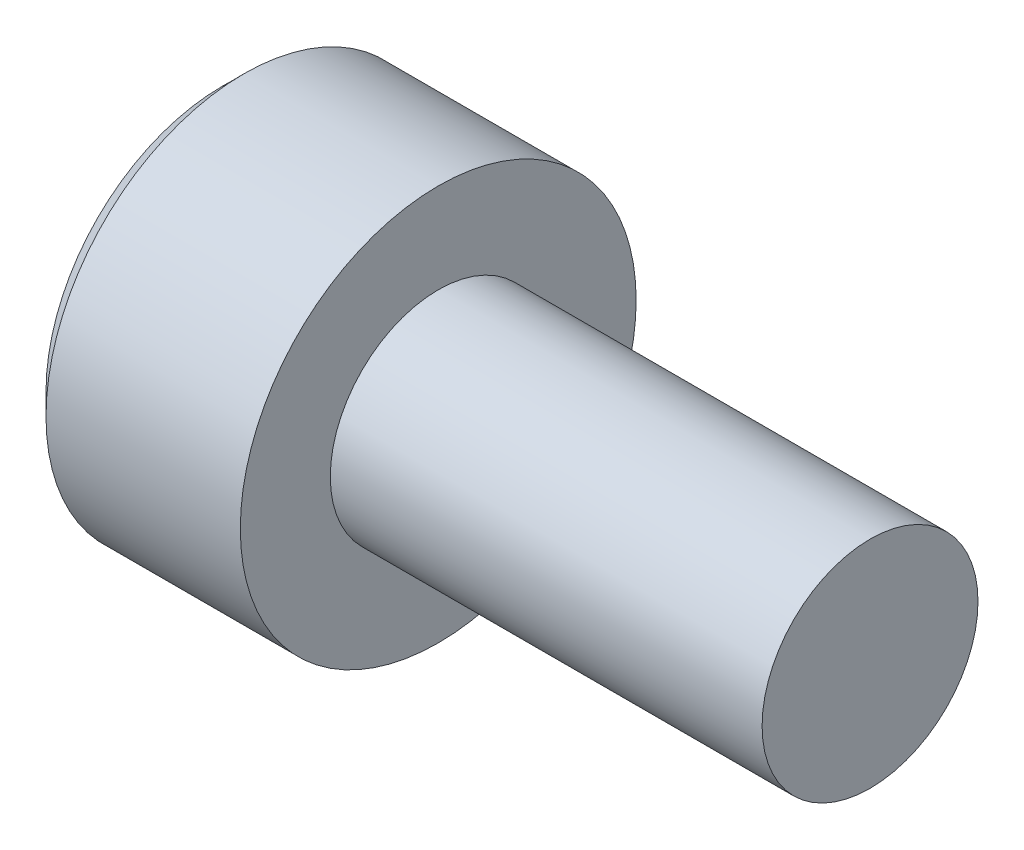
ISO-10303-21;
HEADER;
FILE_DESCRIPTION(('STEP AP214'),'2;1');
FILE_NAME('part.step','',(''),(''),'','','');
FILE_SCHEMA(('AUTOMOTIVE_DESIGN { 1 0 10303 214 1 1 1 1 }'));
ENDSEC;
DATA;
#1=APPLICATION_CONTEXT('core data for automotive mechanical design processes');
#2=APPLICATION_PROTOCOL_DEFINITION('international standard','automotive_design',2000,#1);
#3=PRODUCT_CONTEXT('',#1,'mechanical');
#4=PRODUCT('Part','Part','',(#3));
#5=PRODUCT_RELATED_PRODUCT_CATEGORY('part','',(#4));
#6=PRODUCT_DEFINITION_FORMATION('','',#4);
#7=PRODUCT_DEFINITION_CONTEXT('part definition',#1,'design');
#8=PRODUCT_DEFINITION('design','',#6,#7);
#9=PRODUCT_DEFINITION_SHAPE('','',#8);
#10=(LENGTH_UNIT() NAMED_UNIT(*) SI_UNIT(.MILLI.,.METRE.));
#11=(NAMED_UNIT(*) PLANE_ANGLE_UNIT() SI_UNIT($,.RADIAN.));
#12=(NAMED_UNIT(*) SI_UNIT($,.STERADIAN.) SOLID_ANGLE_UNIT());
#13=UNCERTAINTY_MEASURE_WITH_UNIT(LENGTH_MEASURE(1.E-05),#10,'distance_accuracy_value','');
#14=(GEOMETRIC_REPRESENTATION_CONTEXT(3) GLOBAL_UNCERTAINTY_ASSIGNED_CONTEXT((#13)) GLOBAL_UNIT_ASSIGNED_CONTEXT((#10,
#11,#12)) REPRESENTATION_CONTEXT('',''));
#15=CARTESIAN_POINT('',(0.,0.,0.));
#16=DIRECTION('',(0.,0.,1.));
#17=DIRECTION('',(1.,0.,0.));
#18=AXIS2_PLACEMENT_3D('',#15,#16,#17);
#19=CARTESIAN_POINT('',(-3.,2.75,0.));
#20=DIRECTION('',(1.,0.,0.));
#21=DIRECTION('',(0.,0.,-1.));
#22=AXIS2_PLACEMENT_3D('',#19,#20,#21);
#23=PLANE('',#22);
#24=CARTESIAN_POINT('',(-3.,0.,0.));
#25=DIRECTION('',(1.,0.,0.));
#26=DIRECTION('',(0.,0.,-1.));
#27=AXIS2_PLACEMENT_3D('',#24,#25,#26);
#28=CIRCLE('',#27,2.45);
#29=CARTESIAN_POINT('',(-3.,0.,-2.45));
#30=VERTEX_POINT('',#29);
#31=EDGE_CURVE('E45',#30,#30,#28,.F.);
#32=ORIENTED_EDGE('',*,*,#31,.T.);
#33=EDGE_LOOP('',(#32));
#34=FACE_BOUND('',#33,.T.);
#35=DIRECTION('',(0.,0.5,0.866025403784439));
#36=VECTOR('',#35,1.);
#37=CARTESIAN_POINT('',(-3.,-1.44337567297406,0.));
#38=LINE('',#37,#36);
#39=CARTESIAN_POINT('',(-3.,-1.44337567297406,0.));
#40=VERTEX_POINT('',#39);
#41=CARTESIAN_POINT('',(-3.,-0.721687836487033,1.25));
#42=VERTEX_POINT('',#41);
#43=EDGE_CURVE('E152',#40,#42,#38,.T.);
#44=ORIENTED_EDGE('',*,*,#43,.F.);
#45=DIRECTION('',(0.,-0.5,0.866025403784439));
#46=VECTOR('',#45,1.);
#47=CARTESIAN_POINT('',(-3.,-0.721687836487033,-1.25));
#48=LINE('',#47,#46);
#49=CARTESIAN_POINT('',(-3.,-0.721687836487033,-1.25));
#50=VERTEX_POINT('',#49);
#51=EDGE_CURVE('E52',#50,#40,#48,.T.);
#52=ORIENTED_EDGE('',*,*,#51,.F.);
#53=DIRECTION('',(0.,-1.,0.));
#54=VECTOR('',#53,1.);
#55=CARTESIAN_POINT('',(-3.,0.721687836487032,-1.25));
#56=LINE('',#55,#54);
#57=CARTESIAN_POINT('',(-3.,0.721687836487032,-1.25));
#58=VERTEX_POINT('',#57);
#59=EDGE_CURVE('E122',#58,#50,#56,.T.);
#60=ORIENTED_EDGE('',*,*,#59,.F.);
#61=DIRECTION('',(0.,-0.5,-0.866025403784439));
#62=VECTOR('',#61,1.);
#63=CARTESIAN_POINT('',(-3.,1.44337567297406,0.));
#64=LINE('',#63,#62);
#65=CARTESIAN_POINT('',(-3.,1.44337567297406,0.));
#66=VERTEX_POINT('',#65);
#67=EDGE_CURVE('E158',#66,#58,#64,.T.);
#68=ORIENTED_EDGE('',*,*,#67,.F.);
#69=DIRECTION('',(0.,0.5,-0.866025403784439));
#70=VECTOR('',#69,1.);
#71=CARTESIAN_POINT('',(-3.,0.721687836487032,1.25));
#72=LINE('',#71,#70);
#73=CARTESIAN_POINT('',(-3.,0.721687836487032,1.25));
#74=VERTEX_POINT('',#73);
#75=EDGE_CURVE('E156',#74,#66,#72,.T.);
#76=ORIENTED_EDGE('',*,*,#75,.F.);
#77=DIRECTION('',(0.,1.,0.));
#78=VECTOR('',#77,1.);
#79=CARTESIAN_POINT('',(-3.,-0.721687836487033,1.25));
#80=LINE('',#79,#78);
#81=EDGE_CURVE('E154',#42,#74,#80,.T.);
#82=ORIENTED_EDGE('',*,*,#81,.F.);
#83=EDGE_LOOP('',(#44,#52,#60,#68,#76,#82));
#84=FACE_BOUND('',#83,.T.);
#85=ADVANCED_FACE('F37',(#34,#84),#23,.F.);
#86=CARTESIAN_POINT('',(6.,0.,0.));
#87=DIRECTION('',(-1.,0.,0.));
#88=DIRECTION('',(0.,0.,1.));
#89=AXIS2_PLACEMENT_3D('',#86,#87,#88);
#90=PLANE('',#89);
#91=CARTESIAN_POINT('',(6.,0.,0.));
#92=DIRECTION('',(-1.,0.,0.));
#93=DIRECTION('',(0.,0.,1.));
#94=AXIS2_PLACEMENT_3D('',#91,#92,#93);
#95=CIRCLE('',#94,1.5);
#96=CARTESIAN_POINT('',(6.,0.,1.5));
#97=VERTEX_POINT('',#96);
#98=EDGE_CURVE('E184',#97,#97,#95,.T.);
#99=ORIENTED_EDGE('',*,*,#98,.F.);
#100=EDGE_LOOP('',(#99));
#101=FACE_BOUND('',#100,.T.);
#102=ADVANCED_FACE('F205',(#101),#90,.F.);
#103=CARTESIAN_POINT('',(-3.,0.,0.));
#104=DIRECTION('',(-1.,0.,0.));
#105=DIRECTION('',(0.,0.,1.));
#106=AXIS2_PLACEMENT_3D('',#103,#104,#105);
#107=CYLINDRICAL_SURFACE('',#106,1.5);
#108=CARTESIAN_POINT('',(0.,0.,0.));
#109=DIRECTION('',(-1.,0.,0.));
#110=DIRECTION('',(0.,0.,1.));
#111=AXIS2_PLACEMENT_3D('',#108,#109,#110);
#112=CIRCLE('',#111,1.5);
#113=CARTESIAN_POINT('',(0.,0.,1.5));
#114=VERTEX_POINT('',#113);
#115=EDGE_CURVE('E181',#114,#114,#112,.T.);
#116=ORIENTED_EDGE('',*,*,#115,.F.);
#117=EDGE_LOOP('',(#116));
#118=FACE_BOUND('',#117,.T.);
#119=ORIENTED_EDGE('',*,*,#98,.T.);
#120=EDGE_LOOP('',(#119));
#121=FACE_BOUND('',#120,.T.);
#122=ADVANCED_FACE('F209',(#118,#121),#107,.T.);
#123=CARTESIAN_POINT('',(0.,1.5,0.));
#124=DIRECTION('',(-1.,0.,0.));
#125=DIRECTION('',(0.,0.,1.));
#126=AXIS2_PLACEMENT_3D('',#123,#124,#125);
#127=PLANE('',#126);
#128=CARTESIAN_POINT('',(0.,0.,0.));
#129=DIRECTION('',(-1.,0.,0.));
#130=DIRECTION('',(0.,0.,1.));
#131=AXIS2_PLACEMENT_3D('',#128,#129,#130);
#132=CIRCLE('',#131,2.75);
#133=CARTESIAN_POINT('',(0.,0.,2.75));
#134=VERTEX_POINT('',#133);
#135=EDGE_CURVE('E177',#134,#134,#132,.T.);
#136=ORIENTED_EDGE('',*,*,#135,.F.);
#137=EDGE_LOOP('',(#136));
#138=FACE_BOUND('',#137,.T.);
#139=ORIENTED_EDGE('',*,*,#115,.T.);
#140=EDGE_LOOP('',(#139));
#141=FACE_BOUND('',#140,.T.);
#142=ADVANCED_FACE('F200',(#138,#141),#127,.F.);
#143=CARTESIAN_POINT('',(-3.,0.,0.));
#144=DIRECTION('',(-1.,0.,0.));
#145=DIRECTION('',(0.,0.,1.));
#146=AXIS2_PLACEMENT_3D('',#143,#144,#145);
#147=CYLINDRICAL_SURFACE('',#146,2.75);
#148=CARTESIAN_POINT('',(-2.7,0.,0.));
#149=DIRECTION('',(1.,0.,0.));
#150=DIRECTION('',(0.,0.,-1.));
#151=AXIS2_PLACEMENT_3D('',#148,#149,#150);
#152=CIRCLE('',#151,2.75);
#153=CARTESIAN_POINT('',(-2.7,0.,-2.75));
#154=VERTEX_POINT('',#153);
#155=EDGE_CURVE('E11',#154,#154,#152,.T.);
#156=ORIENTED_EDGE('',*,*,#155,.T.);
#157=EDGE_LOOP('',(#156));
#158=FACE_BOUND('',#157,.T.);
#159=ORIENTED_EDGE('',*,*,#135,.T.);
#160=EDGE_LOOP('',(#159));
#161=FACE_BOUND('',#160,.T.);
#162=ADVANCED_FACE('F192',(#158,#161),#147,.T.);
#163=CARTESIAN_POINT('',(-3.,0.,0.));
#164=DIRECTION('',(1.,0.,0.));
#165=DIRECTION('',(0.,0.,-1.));
#166=AXIS2_PLACEMENT_3D('',#163,#164,#165);
#167=CONICAL_SURFACE('',#166,2.45,0.78539816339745);
#168=ORIENTED_EDGE('',*,*,#155,.F.);
#169=EDGE_LOOP('',(#168));
#170=FACE_BOUND('',#169,.T.);
#171=ORIENTED_EDGE('',*,*,#31,.F.);
#172=EDGE_LOOP('',(#171));
#173=FACE_BOUND('',#172,.T.);
#174=ADVANCED_FACE('F39',(#170,#173),#167,.T.);
#175=CARTESIAN_POINT('',(-1.7,-0.721687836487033,-1.25));
#176=DIRECTION('',(0.,-0.866025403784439,-0.5));
#177=DIRECTION('',(0.,0.5,-0.866025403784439));
#178=AXIS2_PLACEMENT_3D('',#175,#176,#177);
#179=PLANE('',#178);
#180=DIRECTION('',(0.,-0.5,0.866025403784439));
#181=VECTOR('',#180,1.);
#182=CARTESIAN_POINT('',(-1.7,-0.721687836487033,-1.25));
#183=LINE('',#182,#181);
#184=CARTESIAN_POINT('',(-1.7,-0.721687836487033,-1.25));
#185=VERTEX_POINT('',#184);
#186=CARTESIAN_POINT('',(-1.7,-1.08253175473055,-0.625));
#187=VERTEX_POINT('',#186);
#188=EDGE_CURVE('E121',#185,#187,#183,.T.);
#189=ORIENTED_EDGE('',*,*,#188,.F.);
#190=DIRECTION('',(-1.,0.,0.));
#191=VECTOR('',#190,1.);
#192=CARTESIAN_POINT('',(-1.7,-0.721687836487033,-1.25));
#193=LINE('',#192,#191);
#194=EDGE_CURVE('E161',#185,#50,#193,.T.);
#195=ORIENTED_EDGE('',*,*,#194,.T.);
#196=ORIENTED_EDGE('',*,*,#51,.T.);
#197=DIRECTION('',(-1.,0.,0.));
#198=VECTOR('',#197,1.);
#199=CARTESIAN_POINT('',(-1.7,-1.44337567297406,0.));
#200=LINE('',#199,#198);
#201=CARTESIAN_POINT('',(-1.7,-1.44337567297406,0.));
#202=VERTEX_POINT('',#201);
#203=EDGE_CURVE('E124',#202,#40,#200,.T.);
#204=ORIENTED_EDGE('',*,*,#203,.F.);
#205=EDGE_CURVE('E113',#187,#202,#183,.T.);
#206=ORIENTED_EDGE('',*,*,#205,.F.);
#207=EDGE_LOOP('',(#189,#195,#196,#204,#206));
#208=FACE_BOUND('',#207,.T.);
#209=ADVANCED_FACE('F125',(#208),#179,.F.);
#210=CARTESIAN_POINT('',(-1.7,0.721687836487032,-1.25));
#211=DIRECTION('',(0.,0.,-1.));
#212=DIRECTION('',(0.,1.,0.));
#213=AXIS2_PLACEMENT_3D('',#210,#211,#212);
#214=PLANE('',#213);
#215=DIRECTION('',(0.,-1.,0.));
#216=VECTOR('',#215,1.);
#217=CARTESIAN_POINT('',(-1.7,0.721687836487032,-1.25));
#218=LINE('',#217,#216);
#219=CARTESIAN_POINT('',(-1.7,0.721687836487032,-1.25));
#220=VERTEX_POINT('',#219);
#221=CARTESIAN_POINT('',(-1.7,0.,-1.25));
#222=VERTEX_POINT('',#221);
#223=EDGE_CURVE('E130',#220,#222,#218,.T.);
#224=ORIENTED_EDGE('',*,*,#223,.F.);
#225=DIRECTION('',(-1.,0.,0.));
#226=VECTOR('',#225,1.);
#227=CARTESIAN_POINT('',(-1.7,0.721687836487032,-1.25));
#228=LINE('',#227,#226);
#229=EDGE_CURVE('E163',#220,#58,#228,.T.);
#230=ORIENTED_EDGE('',*,*,#229,.T.);
#231=ORIENTED_EDGE('',*,*,#59,.T.);
#232=ORIENTED_EDGE('',*,*,#194,.F.);
#233=EDGE_CURVE('E148',#222,#185,#218,.T.);
#234=ORIENTED_EDGE('',*,*,#233,.F.);
#235=EDGE_LOOP('',(#224,#230,#231,#232,#234));
#236=FACE_BOUND('',#235,.T.);
#237=ADVANCED_FACE('F198',(#236),#214,.F.);
#238=CARTESIAN_POINT('',(-1.7,1.44337567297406,0.));
#239=DIRECTION('',(0.,0.866025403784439,-0.5));
#240=DIRECTION('',(0.,0.5,0.866025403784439));
#241=AXIS2_PLACEMENT_3D('',#238,#239,#240);
#242=PLANE('',#241);
#243=DIRECTION('',(0.,-0.5,-0.866025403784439));
#244=VECTOR('',#243,1.);
#245=CARTESIAN_POINT('',(-1.7,1.44337567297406,0.));
#246=LINE('',#245,#244);
#247=CARTESIAN_POINT('',(-1.7,1.44337567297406,0.));
#248=VERTEX_POINT('',#247);
#249=CARTESIAN_POINT('',(-1.7,1.08253175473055,-0.625));
#250=VERTEX_POINT('',#249);
#251=EDGE_CURVE('E145',#248,#250,#246,.T.);
#252=ORIENTED_EDGE('',*,*,#251,.F.);
#253=DIRECTION('',(-1.,0.,0.));
#254=VECTOR('',#253,1.);
#255=CARTESIAN_POINT('',(-1.7,1.44337567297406,0.));
#256=LINE('',#255,#254);
#257=EDGE_CURVE('E166',#248,#66,#256,.T.);
#258=ORIENTED_EDGE('',*,*,#257,.T.);
#259=ORIENTED_EDGE('',*,*,#67,.T.);
#260=ORIENTED_EDGE('',*,*,#229,.F.);
#261=EDGE_CURVE('E144',#250,#220,#246,.T.);
#262=ORIENTED_EDGE('',*,*,#261,.F.);
#263=EDGE_LOOP('',(#252,#258,#259,#260,#262));
#264=FACE_BOUND('',#263,.T.);
#265=ADVANCED_FACE('F234',(#264),#242,.F.);
#266=CARTESIAN_POINT('',(-1.7,0.721687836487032,1.25));
#267=DIRECTION('',(0.,0.866025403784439,0.5));
#268=DIRECTION('',(0.,-0.5,0.866025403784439));
#269=AXIS2_PLACEMENT_3D('',#266,#267,#268);
#270=PLANE('',#269);
#271=DIRECTION('',(0.,0.5,-0.866025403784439));
#272=VECTOR('',#271,1.);
#273=CARTESIAN_POINT('',(-1.7,0.721687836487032,1.25));
#274=LINE('',#273,#272);
#275=CARTESIAN_POINT('',(-1.7,0.721687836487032,1.25));
#276=VERTEX_POINT('',#275);
#277=CARTESIAN_POINT('',(-1.7,1.08253175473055,0.624999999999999));
#278=VERTEX_POINT('',#277);
#279=EDGE_CURVE('E141',#276,#278,#274,.T.);
#280=ORIENTED_EDGE('',*,*,#279,.F.);
#281=DIRECTION('',(-1.,0.,0.));
#282=VECTOR('',#281,1.);
#283=CARTESIAN_POINT('',(-1.7,0.721687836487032,1.25));
#284=LINE('',#283,#282);
#285=EDGE_CURVE('E169',#276,#74,#284,.T.);
#286=ORIENTED_EDGE('',*,*,#285,.T.);
#287=ORIENTED_EDGE('',*,*,#75,.T.);
#288=ORIENTED_EDGE('',*,*,#257,.F.);
#289=EDGE_CURVE('E140',#278,#248,#274,.T.);
#290=ORIENTED_EDGE('',*,*,#289,.F.);
#291=EDGE_LOOP('',(#280,#286,#287,#288,#290));
#292=FACE_BOUND('',#291,.T.);
#293=ADVANCED_FACE('F230',(#292),#270,.F.);
#294=CARTESIAN_POINT('',(-1.7,-0.721687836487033,1.25));
#295=DIRECTION('',(0.,0.,1.));
#296=DIRECTION('',(1.,0.,0.));
#297=AXIS2_PLACEMENT_3D('',#294,#295,#296);
#298=PLANE('',#297);
#299=DIRECTION('',(0.,1.,0.));
#300=VECTOR('',#299,1.);
#301=CARTESIAN_POINT('',(-1.7,-0.721687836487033,1.25));
#302=LINE('',#301,#300);
#303=CARTESIAN_POINT('',(-1.7,-0.721687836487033,1.25));
#304=VERTEX_POINT('',#303);
#305=CARTESIAN_POINT('',(-1.7,0.,1.25));
#306=VERTEX_POINT('',#305);
#307=EDGE_CURVE('E60',#304,#306,#302,.T.);
#308=ORIENTED_EDGE('',*,*,#307,.F.);
#309=DIRECTION('',(-1.,0.,0.));
#310=VECTOR('',#309,1.);
#311=CARTESIAN_POINT('',(-1.7,-0.721687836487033,1.25));
#312=LINE('',#311,#310);
#313=EDGE_CURVE('E129',#304,#42,#312,.T.);
#314=ORIENTED_EDGE('',*,*,#313,.T.);
#315=ORIENTED_EDGE('',*,*,#81,.T.);
#316=ORIENTED_EDGE('',*,*,#285,.F.);
#317=EDGE_CURVE('E136',#306,#276,#302,.T.);
#318=ORIENTED_EDGE('',*,*,#317,.F.);
#319=EDGE_LOOP('',(#308,#314,#315,#316,#318));
#320=FACE_BOUND('',#319,.T.);
#321=ADVANCED_FACE('F227',(#320),#298,.F.);
#322=CARTESIAN_POINT('',(-1.7,-1.44337567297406,0.));
#323=DIRECTION('',(0.,-0.866025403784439,0.5));
#324=DIRECTION('',(0.,-0.5,-0.866025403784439));
#325=AXIS2_PLACEMENT_3D('',#322,#323,#324);
#326=PLANE('',#325);
#327=DIRECTION('',(0.,0.5,0.866025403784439));
#328=VECTOR('',#327,1.);
#329=CARTESIAN_POINT('',(-1.7,-1.44337567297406,0.));
#330=LINE('',#329,#328);
#331=CARTESIAN_POINT('',(-1.7,-1.08253175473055,0.625));
#332=VERTEX_POINT('',#331);
#333=EDGE_CURVE('E116',#202,#332,#330,.T.);
#334=ORIENTED_EDGE('',*,*,#333,.F.);
#335=ORIENTED_EDGE('',*,*,#203,.T.);
#336=ORIENTED_EDGE('',*,*,#43,.T.);
#337=ORIENTED_EDGE('',*,*,#313,.F.);
#338=EDGE_CURVE('E135',#332,#304,#330,.T.);
#339=ORIENTED_EDGE('',*,*,#338,.F.);
#340=EDGE_LOOP('',(#334,#335,#336,#337,#339));
#341=FACE_BOUND('',#340,.T.);
#342=ADVANCED_FACE('F133',(#341),#326,.F.);
#343=CARTESIAN_POINT('',(-1.7,0.,0.));
#344=DIRECTION('',(-1.,0.,0.));
#345=DIRECTION('',(0.,0.,1.));
#346=AXIS2_PLACEMENT_3D('',#343,#344,#345);
#347=PLANE('',#346);
#348=ORIENTED_EDGE('',*,*,#317,.T.);
#349=ORIENTED_EDGE('',*,*,#279,.T.);
#350=CARTESIAN_POINT('',(-1.7,0.,0.));
#351=DIRECTION('',(-1.,0.,0.));
#352=DIRECTION('',(0.,-1.,0.));
#353=AXIS2_PLACEMENT_3D('',#350,#351,#352);
#354=CIRCLE('',#353,1.25);
#355=EDGE_CURVE('E178',#306,#278,#354,.T.);
#356=ORIENTED_EDGE('',*,*,#355,.F.);
#357=EDGE_LOOP('',(#348,#349,#356));
#358=FACE_BOUND('',#357,.T.);
#359=ADVANCED_FACE('F226',(#358),#347,.T.);
#360=ORIENTED_EDGE('',*,*,#289,.T.);
#361=ORIENTED_EDGE('',*,*,#251,.T.);
#362=EDGE_CURVE('E264',#278,#250,#354,.T.);
#363=ORIENTED_EDGE('',*,*,#362,.F.);
#364=EDGE_LOOP('',(#360,#361,#363));
#365=FACE_BOUND('',#364,.T.);
#366=ADVANCED_FACE('F248',(#365),#347,.T.);
#367=ORIENTED_EDGE('',*,*,#261,.T.);
#368=ORIENTED_EDGE('',*,*,#223,.T.);
#369=EDGE_CURVE('E266',#250,#222,#354,.T.);
#370=ORIENTED_EDGE('',*,*,#369,.F.);
#371=EDGE_LOOP('',(#367,#368,#370));
#372=FACE_BOUND('',#371,.T.);
#373=ADVANCED_FACE('F253',(#372),#347,.T.);
#374=ORIENTED_EDGE('',*,*,#233,.T.);
#375=ORIENTED_EDGE('',*,*,#188,.T.);
#376=EDGE_CURVE('E267',#222,#187,#354,.T.);
#377=ORIENTED_EDGE('',*,*,#376,.F.);
#378=EDGE_LOOP('',(#374,#375,#377));
#379=FACE_BOUND('',#378,.T.);
#380=ADVANCED_FACE('F246',(#379),#347,.T.);
#381=ORIENTED_EDGE('',*,*,#205,.T.);
#382=ORIENTED_EDGE('',*,*,#333,.T.);
#383=EDGE_CURVE('E118',#187,#332,#354,.T.);
#384=ORIENTED_EDGE('',*,*,#383,.F.);
#385=EDGE_LOOP('',(#381,#382,#384));
#386=FACE_BOUND('',#385,.T.);
#387=ADVANCED_FACE('F114',(#386),#347,.T.);
#388=ORIENTED_EDGE('',*,*,#338,.T.);
#389=ORIENTED_EDGE('',*,*,#307,.T.);
#390=EDGE_CURVE('E174',#332,#306,#354,.T.);
#391=ORIENTED_EDGE('',*,*,#390,.F.);
#392=EDGE_LOOP('',(#388,#389,#391));
#393=FACE_BOUND('',#392,.T.);
#394=ADVANCED_FACE('F221',(#393),#347,.T.);
#395=CARTESIAN_POINT('',(-0.948924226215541,0.,0.));
#396=DIRECTION('',(-1.,0.,0.));
#397=DIRECTION('',(0.,-1.,0.));
#398=AXIS2_PLACEMENT_3D('',#395,#396,#397);
#399=CONICAL_SURFACE('',#398,0.,1.02974425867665);
#400=ORIENTED_EDGE('',*,*,#390,.T.);
#401=ORIENTED_EDGE('',*,*,#355,.T.);
#402=ORIENTED_EDGE('',*,*,#362,.T.);
#403=ORIENTED_EDGE('',*,*,#369,.T.);
#404=ORIENTED_EDGE('',*,*,#376,.T.);
#405=ORIENTED_EDGE('',*,*,#383,.T.);
#406=EDGE_LOOP('',(#400,#401,#402,#403,#404,#405));
#407=FACE_BOUND('',#406,.T.);
#408=CARTESIAN_POINT('',(-0.948924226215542,0.,0.));
#409=VERTEX_POINT('',#408);
#410=VERTEX_LOOP('',#409);
#411=FACE_BOUND('',#410,.T.);
#412=ADVANCED_FACE('F219',(#407,#411),#399,.F.);
#413=CLOSED_SHELL('',(#85,#102,#122,#142,#162,#174,#209,#237,#265,#293,#321,#342,#359,#366,#373,
#380,#387,#394,#412));
#414=MANIFOLD_SOLID_BREP('B2',#413);
#415=ADVANCED_BREP_SHAPE_REPRESENTATION('',(#18,#414),#14);
#416=SHAPE_DEFINITION_REPRESENTATION(#9,#415);
ENDSEC;
END-ISO-10303-21;
